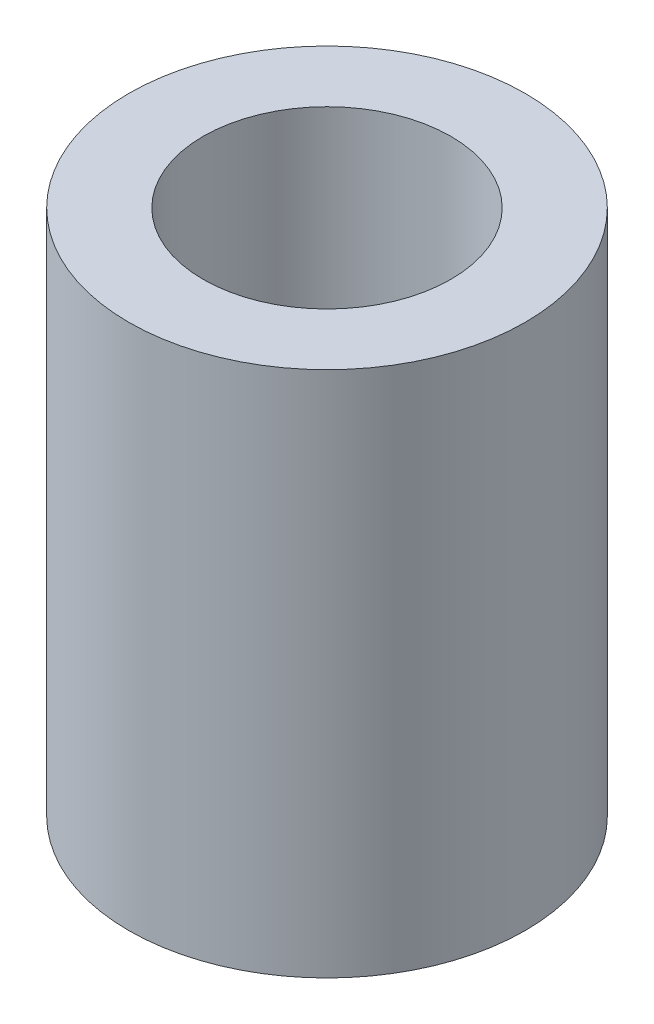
ISO-10303-21;
HEADER;
FILE_DESCRIPTION(('STEP AP214'),'2;1');
FILE_NAME('part.step','',(''),(''),'','','');
FILE_SCHEMA(('AUTOMOTIVE_DESIGN { 1 0 10303 214 1 1 1 1 }'));
ENDSEC;
DATA;
#1=APPLICATION_CONTEXT('core data for automotive mechanical design processes');
#2=APPLICATION_PROTOCOL_DEFINITION('international standard','automotive_design',2000,#1);
#3=PRODUCT_CONTEXT('',#1,'mechanical');
#4=PRODUCT('Part','Part','',(#3));
#5=PRODUCT_RELATED_PRODUCT_CATEGORY('part','',(#4));
#6=PRODUCT_DEFINITION_FORMATION('','',#4);
#7=PRODUCT_DEFINITION_CONTEXT('part definition',#1,'design');
#8=PRODUCT_DEFINITION('design','',#6,#7);
#9=PRODUCT_DEFINITION_SHAPE('','',#8);
#10=(LENGTH_UNIT() NAMED_UNIT(*) SI_UNIT(.MILLI.,.METRE.));
#11=(NAMED_UNIT(*) PLANE_ANGLE_UNIT() SI_UNIT($,.RADIAN.));
#12=(NAMED_UNIT(*) SI_UNIT($,.STERADIAN.) SOLID_ANGLE_UNIT());
#13=UNCERTAINTY_MEASURE_WITH_UNIT(LENGTH_MEASURE(1.E-05),#10,'distance_accuracy_value','');
#14=(GEOMETRIC_REPRESENTATION_CONTEXT(3) GLOBAL_UNCERTAINTY_ASSIGNED_CONTEXT((#13)) GLOBAL_UNIT_ASSIGNED_CONTEXT((#10,
#11,#12)) REPRESENTATION_CONTEXT('',''));
#15=CARTESIAN_POINT('',(0.,0.,0.));
#16=DIRECTION('',(0.,0.,1.));
#17=DIRECTION('',(1.,0.,0.));
#18=AXIS2_PLACEMENT_3D('',#15,#16,#17);
#19=CARTESIAN_POINT('',(0.,10.63,0.));
#20=DIRECTION('',(0.,-1.,0.));
#21=DIRECTION('',(0.,0.,-1.));
#22=AXIS2_PLACEMENT_3D('',#19,#20,#21);
#23=CYLINDRICAL_SURFACE('',#22,2.5);
#24=CARTESIAN_POINT('',(0.,0.,0.));
#25=DIRECTION('',(0.,-1.,0.));
#26=DIRECTION('',(0.,0.,-1.));
#27=AXIS2_PLACEMENT_3D('',#24,#25,#26);
#28=CIRCLE('',#27,2.5);
#29=CARTESIAN_POINT('',(0.,0.,-2.5));
#30=VERTEX_POINT('',#29);
#31=EDGE_CURVE('E27',#30,#30,#28,.T.);
#32=ORIENTED_EDGE('',*,*,#31,.T.);
#33=EDGE_LOOP('',(#32));
#34=FACE_BOUND('',#33,.T.);
#35=CARTESIAN_POINT('',(0.,10.63,0.));
#36=DIRECTION('',(0.,-1.,0.));
#37=DIRECTION('',(0.,0.,-1.));
#38=AXIS2_PLACEMENT_3D('',#35,#36,#37);
#39=CIRCLE('',#38,2.5);
#40=CARTESIAN_POINT('',(0.,10.63,-2.5));
#41=VERTEX_POINT('',#40);
#42=EDGE_CURVE('E18',#41,#41,#39,.T.);
#43=ORIENTED_EDGE('',*,*,#42,.F.);
#44=EDGE_LOOP('',(#43));
#45=FACE_BOUND('',#44,.T.);
#46=ADVANCED_FACE('F15',(#34,#45),#23,.F.);
#47=CARTESIAN_POINT('',(0.,10.63,0.));
#48=DIRECTION('',(0.,1.,0.));
#49=DIRECTION('',(0.,0.,1.));
#50=AXIS2_PLACEMENT_3D('',#47,#48,#49);
#51=PLANE('',#50);
#52=ORIENTED_EDGE('',*,*,#42,.T.);
#53=EDGE_LOOP('',(#52));
#54=FACE_BOUND('',#53,.T.);
#55=CARTESIAN_POINT('',(0.,10.63,0.));
#56=DIRECTION('',(0.,-1.,0.));
#57=DIRECTION('',(0.,0.,-1.));
#58=AXIS2_PLACEMENT_3D('',#55,#56,#57);
#59=CIRCLE('',#58,4.);
#60=CARTESIAN_POINT('',(0.,10.63,-4.));
#61=VERTEX_POINT('',#60);
#62=EDGE_CURVE('E22',#61,#61,#59,.T.);
#63=ORIENTED_EDGE('',*,*,#62,.F.);
#64=EDGE_LOOP('',(#63));
#65=FACE_BOUND('',#64,.T.);
#66=ADVANCED_FACE('F35',(#54,#65),#51,.T.);
#67=CARTESIAN_POINT('',(0.,0.,0.));
#68=DIRECTION('',(0.,1.,0.));
#69=DIRECTION('',(0.,0.,1.));
#70=AXIS2_PLACEMENT_3D('',#67,#68,#69);
#71=PLANE('',#70);
#72=ORIENTED_EDGE('',*,*,#31,.F.);
#73=EDGE_LOOP('',(#72));
#74=FACE_BOUND('',#73,.T.);
#75=CARTESIAN_POINT('',(0.,0.,0.));
#76=DIRECTION('',(0.,-1.,0.));
#77=DIRECTION('',(0.,0.,-1.));
#78=AXIS2_PLACEMENT_3D('',#75,#76,#77);
#79=CIRCLE('',#78,4.);
#80=CARTESIAN_POINT('',(0.,0.,-4.));
#81=VERTEX_POINT('',#80);
#82=EDGE_CURVE('E10',#81,#81,#79,.F.);
#83=ORIENTED_EDGE('',*,*,#82,.F.);
#84=EDGE_LOOP('',(#83));
#85=FACE_BOUND('',#84,.T.);
#86=ADVANCED_FACE('F43',(#74,#85),#71,.F.);
#87=CARTESIAN_POINT('',(0.,10.63,0.));
#88=DIRECTION('',(0.,-1.,0.));
#89=DIRECTION('',(0.,0.,-1.));
#90=AXIS2_PLACEMENT_3D('',#87,#88,#89);
#91=CYLINDRICAL_SURFACE('',#90,4.);
#92=ORIENTED_EDGE('',*,*,#82,.T.);
#93=EDGE_LOOP('',(#92));
#94=FACE_BOUND('',#93,.T.);
#95=ORIENTED_EDGE('',*,*,#62,.T.);
#96=EDGE_LOOP('',(#95));
#97=FACE_BOUND('',#96,.T.);
#98=ADVANCED_FACE('F44',(#94,#97),#91,.T.);
#99=CLOSED_SHELL('',(#46,#66,#86,#98));
#100=MANIFOLD_SOLID_BREP('B1',#99);
#101=ADVANCED_BREP_SHAPE_REPRESENTATION('',(#18,#100),#14);
#102=SHAPE_DEFINITION_REPRESENTATION(#9,#101);
ENDSEC;
END-ISO-10303-21;
